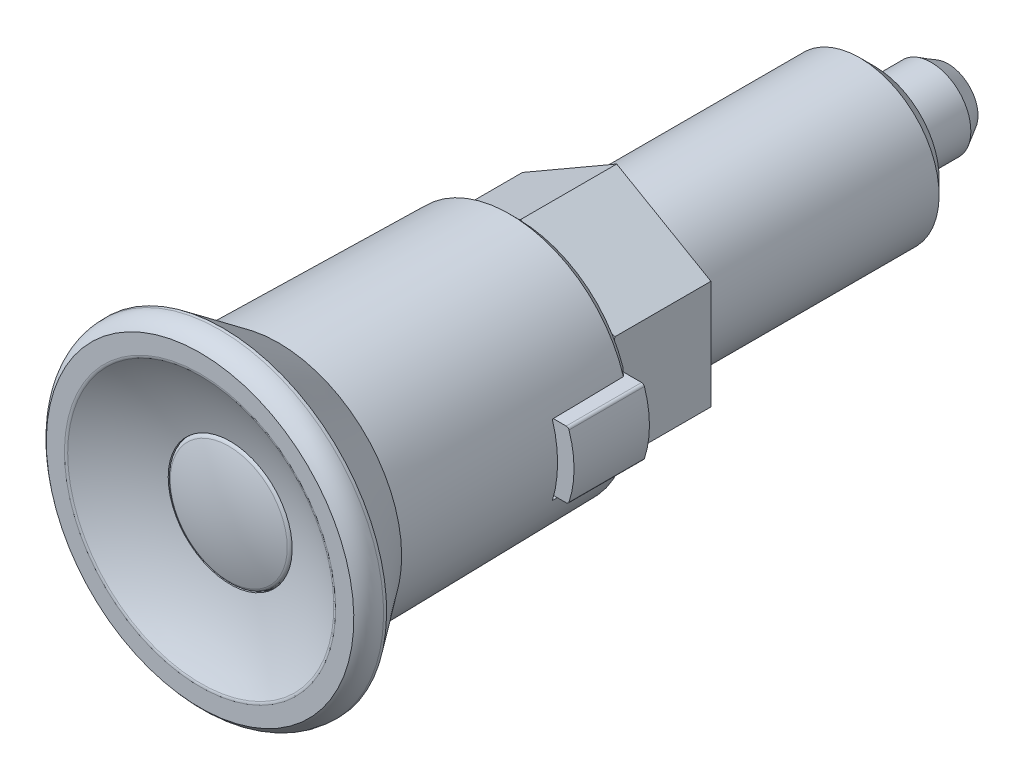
ISO-10303-21;
HEADER;
FILE_DESCRIPTION(('STEP AP214'),'2;1');
FILE_NAME('part.step','',(''),(''),'','','');
FILE_SCHEMA(('AUTOMOTIVE_DESIGN { 1 0 10303 214 1 1 1 1 }'));
ENDSEC;
DATA;
#1=APPLICATION_CONTEXT('core data for automotive mechanical design processes');
#2=APPLICATION_PROTOCOL_DEFINITION('international standard','automotive_design',2000,#1);
#3=PRODUCT_CONTEXT('',#1,'mechanical');
#4=PRODUCT('Part','Part','',(#3));
#5=PRODUCT_RELATED_PRODUCT_CATEGORY('part','',(#4));
#6=PRODUCT_DEFINITION_FORMATION('','',#4);
#7=PRODUCT_DEFINITION_CONTEXT('part definition',#1,'design');
#8=PRODUCT_DEFINITION('design','',#6,#7);
#9=PRODUCT_DEFINITION_SHAPE('','',#8);
#10=(LENGTH_UNIT() NAMED_UNIT(*) SI_UNIT(.MILLI.,.METRE.));
#11=(NAMED_UNIT(*) PLANE_ANGLE_UNIT() SI_UNIT($,.RADIAN.));
#12=(NAMED_UNIT(*) SI_UNIT($,.STERADIAN.) SOLID_ANGLE_UNIT());
#13=UNCERTAINTY_MEASURE_WITH_UNIT(LENGTH_MEASURE(1.E-05),#10,'distance_accuracy_value','');
#14=(GEOMETRIC_REPRESENTATION_CONTEXT(3) GLOBAL_UNCERTAINTY_ASSIGNED_CONTEXT((#13)) GLOBAL_UNIT_ASSIGNED_CONTEXT((#10,
#11,#12)) REPRESENTATION_CONTEXT('',''));
#15=CARTESIAN_POINT('',(0.,0.,0.));
#16=DIRECTION('',(0.,0.,1.));
#17=DIRECTION('',(1.,0.,0.));
#18=AXIS2_PLACEMENT_3D('',#15,#16,#17);
#19=CARTESIAN_POINT('',(9.3,-4.55,18.1));
#20=DIRECTION('',(0.,0.,1.));
#21=DIRECTION('',(0.,-1.,0.));
#22=AXIS2_PLACEMENT_3D('',#19,#20,#21);
#23=PLANE('',#22);
#24=DIRECTION('',(0.,-1.,0.));
#25=VECTOR('',#24,1.);
#26=CARTESIAN_POINT('',(9.8,4.55,18.1));
#27=LINE('',#26,#25);
#28=CARTESIAN_POINT('',(9.8,3.55,18.1));
#29=VERTEX_POINT('',#28);
#30=CARTESIAN_POINT('',(9.8,-3.55,18.1));
#31=VERTEX_POINT('',#30);
#32=EDGE_CURVE('E159',#29,#31,#27,.T.);
#33=ORIENTED_EDGE('',*,*,#32,.F.);
#34=DIRECTION('',(-1.,0.,0.));
#35=VECTOR('',#34,1.);
#36=CARTESIAN_POINT('',(16.5,3.55,18.1));
#37=LINE('',#36,#35);
#38=CARTESIAN_POINT('',(11.6108033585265,3.55,18.1));
#39=VERTEX_POINT('',#38);
#40=EDGE_CURVE('E182',#39,#29,#37,.T.);
#41=ORIENTED_EDGE('',*,*,#40,.F.);
#42=CARTESIAN_POINT('',(0.,0.,18.1));
#43=DIRECTION('',(0.,0.,1.));
#44=DIRECTION('',(0.,-1.,0.));
#45=AXIS2_PLACEMENT_3D('',#42,#43,#44);
#46=CIRCLE('',#45,12.1413860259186);
#47=CARTESIAN_POINT('',(11.6108033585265,-3.55,18.1));
#48=VERTEX_POINT('',#47);
#49=EDGE_CURVE('E283',#48,#39,#46,.T.);
#50=ORIENTED_EDGE('',*,*,#49,.F.);
#51=DIRECTION('',(1.,0.,0.));
#52=VECTOR('',#51,1.);
#53=CARTESIAN_POINT('',(9.8,-3.55,18.1));
#54=LINE('',#53,#52);
#55=EDGE_CURVE('E179',#31,#48,#54,.T.);
#56=ORIENTED_EDGE('',*,*,#55,.F.);
#57=EDGE_LOOP('',(#33,#41,#50,#56));
#58=FACE_BOUND('',#57,.T.);
#59=ADVANCED_FACE('F14',(#58),#23,.F.);
#60=CARTESIAN_POINT('',(0.,0.,64.2));
#61=DIRECTION('',(0.,0.,-1.));
#62=DIRECTION('',(-1.,0.,0.));
#63=AXIS2_PLACEMENT_3D('',#60,#61,#62);
#64=SPHERICAL_SURFACE('',#63,26.);
#65=CARTESIAN_POINT('',(0.,0.,41.9283018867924));
#66=DIRECTION('',(0.,0.,-1.));
#67=DIRECTION('',(0.,1.,0.));
#68=AXIS2_PLACEMENT_3D('',#65,#66,#67);
#69=CIRCLE('',#68,13.4153443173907);
#70=CARTESIAN_POINT('',(-13.4153443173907,0.,41.9283018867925));
#71=VERTEX_POINT('',#70);
#72=EDGE_CURVE('E301',#71,#71,#69,.T.);
#73=CARTESIAN_POINT('',(0.,0.,38.9623792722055));
#74=DIRECTION('',(0.,0.,1.));
#75=DIRECTION('',(0.,-1.,0.));
#76=AXIS2_PLACEMENT_3D('',#73,#74,#75);
#77=CIRCLE('',#76,6.25);
#78=CARTESIAN_POINT('',(-6.24999999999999,0.,38.9623792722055));
#79=VERTEX_POINT('',#78);
#80=EDGE_CURVE('E494',#79,#79,#77,.T.);
#81=CARTESIAN_POINT('',(-13.4153443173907,0.,41.9283018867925));
#82=CARTESIAN_POINT('',(-13.3458883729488,0.,41.8864651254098));
#83=CARTESIAN_POINT('',(-13.2762367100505,0.,41.8449532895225));
#84=CARTESIAN_POINT('',(-13.1365480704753,0.,41.762583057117));
#85=CARTESIAN_POINT('',(-13.0665110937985,0.,41.7217246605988));
#86=CARTESIAN_POINT('',(-12.9260579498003,0.,41.6406648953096));
#87=CARTESIAN_POINT('',(-12.8556417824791,0.,41.6004635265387));
#88=CARTESIAN_POINT('',(-12.7144364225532,0.,41.5207213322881));
#89=CARTESIAN_POINT('',(-12.6436472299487,0.,41.4811805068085));
#90=CARTESIAN_POINT('',(-12.5017020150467,0.,41.4027628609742));
#91=CARTESIAN_POINT('',(-12.4305459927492,0.,41.3638860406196));
#92=CARTESIAN_POINT('',(-12.2878733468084,0.,41.2867998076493));
#93=CARTESIAN_POINT('',(-12.2163567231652,0.,41.2485903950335));
#94=CARTESIAN_POINT('',(-12.0729691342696,0.,41.1728423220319));
#95=CARTESIAN_POINT('',(-12.0010981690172,0.,41.1353036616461));
#96=CARTESIAN_POINT('',(-11.8570081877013,0.,41.0609003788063));
#97=CARTESIAN_POINT('',(-11.7847891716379,0.,41.0240357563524));
#98=CARTESIAN_POINT('',(-11.6400094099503,0.,40.9509837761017));
#99=CARTESIAN_POINT('',(-11.5674486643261,0.,40.9147964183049));
#100=CARTESIAN_POINT('',(-11.4219917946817,0.,40.8431021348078));
#101=CARTESIAN_POINT('',(-11.3490956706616,0.,40.8075952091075));
#102=CARTESIAN_POINT('',(-11.2029744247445,0.,40.7372648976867));
#103=CARTESIAN_POINT('',(-11.1297493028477,0.,40.7024415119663));
#104=CARTESIAN_POINT('',(-10.9829764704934,0.,40.6334813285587));
#105=CARTESIAN_POINT('',(-10.9094287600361,0.,40.5993445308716));
#106=CARTESIAN_POINT('',(-10.762017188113,0.,40.5317605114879));
#107=CARTESIAN_POINT('',(-10.6881533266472,0.,40.4983132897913));
#108=CARTESIAN_POINT('',(-10.5401159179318,0.,40.4321113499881));
#109=CARTESIAN_POINT('',(-10.4659423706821,0.,40.3993566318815));
#110=CARTESIAN_POINT('',(-10.3172920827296,0.,40.3345425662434));
#111=CARTESIAN_POINT('',(-10.2428153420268,0.,40.302483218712));
#112=CARTESIAN_POINT('',(-10.0935651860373,0.,40.2390627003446));
#113=CARTESIAN_POINT('',(-10.0187917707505,0.,40.2077015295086));
#114=CARTESIAN_POINT('',(-9.86895481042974,0.,40.1456801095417));
#115=CARTESIAN_POINT('',(-9.7938912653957,0.,40.1150198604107));
#116=CARTESIAN_POINT('',(-9.64348061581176,0.,40.0544029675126));
#117=CARTESIAN_POINT('',(-9.56813351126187,0.,40.0244463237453));
#118=CARTESIAN_POINT('',(-9.41716233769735,0.,39.9652392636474));
#119=CARTESIAN_POINT('',(-9.34153826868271,0.,39.9359888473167));
#120=CARTESIAN_POINT('',(-9.1900197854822,0.,39.8781968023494));
#121=CARTESIAN_POINT('',(-9.11412537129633,0.,39.8496551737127));
#122=CARTESIAN_POINT('',(-8.96207284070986,0.,39.7932832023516));
#123=CARTESIAN_POINT('',(-8.88591472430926,0.,39.7654528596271));
#124=CARTESIAN_POINT('',(-8.73334145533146,0.,39.7105058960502));
#125=CARTESIAN_POINT('',(-8.65692630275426,0.,39.6833892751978));
#126=CARTESIAN_POINT('',(-8.50384564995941,0.,39.6298721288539));
#127=CARTESIAN_POINT('',(-8.42718014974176,0.,39.6034716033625));
#128=CARTESIAN_POINT('',(-8.27360551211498,0.,39.5513889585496));
#129=CARTESIAN_POINT('',(-8.19669637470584,0.,39.5257068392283));
#130=CARTESIAN_POINT('',(-8.04264119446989,0.,39.4750632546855));
#131=CARTESIAN_POINT('',(-7.96549515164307,0.,39.450101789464));
#132=CARTESIAN_POINT('',(-7.81097291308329,0.,39.400901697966));
#133=CARTESIAN_POINT('',(-7.73359671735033,0.,39.3766630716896));
#134=CARTESIAN_POINT('',(-7.5786209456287,0.,39.3289107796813));
#135=CARTESIAN_POINT('',(-7.50102136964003,0.,39.3053971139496));
#136=CARTESIAN_POINT('',(-7.34560562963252,0.,39.2590968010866));
#137=CARTESIAN_POINT('',(-7.26778946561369,0.,39.2363101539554));
#138=CARTESIAN_POINT('',(-7.11194736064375,0.,39.1914658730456));
#139=CARTESIAN_POINT('',(-7.03392141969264,0.,39.1694082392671));
#140=CARTESIAN_POINT('',(-6.87766659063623,0.,39.1260239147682));
#141=CARTESIAN_POINT('',(-6.79943770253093,0.,39.1046972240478));
#142=CARTESIAN_POINT('',(-6.64278382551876,0.,39.0627766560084));
#143=CARTESIAN_POINT('',(-6.56435883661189,0.,39.0421827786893));
#144=CARTESIAN_POINT('',(-6.40731962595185,0.,39.0017296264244));
#145=CARTESIAN_POINT('',(-6.32870540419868,0.,38.9818703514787));
#146=CARTESIAN_POINT('',(-6.24999999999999,0.,38.9623792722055));
#147=B_SPLINE_CURVE_WITH_KNOTS('',3,(#81,#82,#83,#84,#85,#86,#87,#88,#89,#90,#91,#92,#93,#94,
#95,#96,#97,#98,#99,#100,#101,#102,#103,#104,#105,#106,#107,#108,#109,#110,#111,#112,#113,#114,
#115,#116,#117,#118,#119,#120,#121,#122,#123,#124,#125,#126,#127,#128,#129,#130,#131,#132,#133,
#134,#135,#136,#137,#138,#139,#140,#141,#142,#143,#144,#145,#146),.UNSPECIFIED.,.F.,.F.,(4,2,2,
2,2,2,2,2,2,2,2,2,2,2,2,2,2,2,2,2,2,2,2,2,2,2,2,2,2,2,2,2,4),(0.,0.243247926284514,
0.486495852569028,0.729743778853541,0.972991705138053,1.21623963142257,1.45948755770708,
1.7027354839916,1.94598341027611,2.18923133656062,2.43247926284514,2.67572718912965,
2.91897511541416,3.16222304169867,3.40547096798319,3.6487188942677,3.89196682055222,
4.13521474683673,4.37846267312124,4.62171059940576,4.86495852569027,5.10820645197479,
5.3514543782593,5.59470230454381,5.83795023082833,6.08119815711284,6.32444608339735,
6.56769400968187,6.81094193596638,7.05418986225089,7.29743778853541,7.54068571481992,
7.78393364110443),.UNSPECIFIED.);
#148=EDGE_CURVE('BSEAM16',#71,#79,#147,.T.);
#149=ORIENTED_EDGE('',*,*,#72,.F.);
#150=ORIENTED_EDGE('',*,*,#80,.F.);
#151=ORIENTED_EDGE('',*,*,#148,.T.);
#152=ORIENTED_EDGE('',*,*,#148,.F.);
#153=EDGE_LOOP('',(#149,#151,#150,#152));
#154=FACE_BOUND('',#153,.T.);
#155=ADVANCED_FACE('F16',(#154),#64,.F.);
#156=CARTESIAN_POINT('',(0.,0.,10.));
#157=DIRECTION('',(0.,0.,-1.));
#158=DIRECTION('',(0.,1.,0.));
#159=AXIS2_PLACEMENT_3D('',#156,#157,#158);
#160=CONICAL_SURFACE('',#159,9.5,1.36135681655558);
#161=CARTESIAN_POINT('',(-9.5,14.5329336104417,8.32877554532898));
#162=CARTESIAN_POINT('',(-9.5,14.1013570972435,8.40553990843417));
#163=CARTESIAN_POINT('',(-9.5,13.6696077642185,8.48134980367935));
#164=CARTESIAN_POINT('',(-9.5,12.8056798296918,8.63055194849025));
#165=CARTESIAN_POINT('',(-9.5,12.3735012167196,8.70394413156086));
#166=CARTESIAN_POINT('',(-9.5,11.5083909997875,8.8478417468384));
#167=CARTESIAN_POINT('',(-9.5,11.0754590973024,8.91834539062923));
#168=CARTESIAN_POINT('',(-9.5,10.2090221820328,9.05573636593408));
#169=CARTESIAN_POINT('',(-9.5,9.77551717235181,9.12262371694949));
#170=CARTESIAN_POINT('',(-9.5,8.90997113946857,9.2516178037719));
#171=CARTESIAN_POINT('',(-9.5,8.47793339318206,9.31374642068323));
#172=CARTESIAN_POINT('',(-9.5,7.61310957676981,9.43254691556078));
#173=CARTESIAN_POINT('',(-9.5,7.18032351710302,9.48921886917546));
#174=CARTESIAN_POINT('',(-9.5,6.31395168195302,9.59585082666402));
#175=CARTESIAN_POINT('',(-9.5,5.88036596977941,9.64581134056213));
#176=CARTESIAN_POINT('',(-9.5,5.01232298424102,9.73757725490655));
#177=CARTESIAN_POINT('',(-9.5,4.57786571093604,9.77938265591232));
#178=CARTESIAN_POINT('',(-9.5,3.7050826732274,9.85353883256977));
#179=CARTESIAN_POINT('',(-9.5,3.2667510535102,9.88582167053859));
#180=CARTESIAN_POINT('',(-9.5,2.38939284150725,9.93902642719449));
#181=CARTESIAN_POINT('',(-9.5,1.9503662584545,9.95994849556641));
#182=CARTESIAN_POINT('',(-9.5,1.07200933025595,9.98927460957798));
#183=CARTESIAN_POINT('',(-9.5,0.632679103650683,9.99768213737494));
#184=CARTESIAN_POINT('',(-9.5,-0.246038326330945,10.0014817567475));
#185=CARTESIAN_POINT('',(-9.5,-0.685425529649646,9.99687386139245));
#186=CARTESIAN_POINT('',(-9.5,-1.56488299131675,9.974899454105));
#187=CARTESIAN_POINT('',(-9.5,-2.00495250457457,9.95750370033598));
#188=CARTESIAN_POINT('',(-9.5,-2.88446098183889,9.91091726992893));
#189=CARTESIAN_POINT('',(-9.5,-3.32389993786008,9.88172644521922));
#190=CARTESIAN_POINT('',(-9.5,-4.20212718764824,9.81298518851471));
#191=CARTESIAN_POINT('',(-9.5,-4.6409151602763,9.7734307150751));
#192=CARTESIAN_POINT('',(-9.5,-5.51760463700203,9.68557090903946));
#193=CARTESIAN_POINT('',(-9.5,-5.95550613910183,9.63726555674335));
#194=CARTESIAN_POINT('',(-9.5,-6.80881686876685,9.53600307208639));
#195=CARTESIAN_POINT('',(-9.5,-7.22426780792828,9.48339396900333));
#196=CARTESIAN_POINT('',(-9.5,-8.05445875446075,9.37281160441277));
#197=CARTESIAN_POINT('',(-9.5,-8.46919874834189,9.31483824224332));
#198=CARTESIAN_POINT('',(-9.5,-9.29806516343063,9.19450464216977));
#199=CARTESIAN_POINT('',(-9.5,-9.71219154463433,9.13214413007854));
#200=CARTESIAN_POINT('',(-9.5,-10.5398894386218,9.00383477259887));
#201=CARTESIAN_POINT('',(-9.5,-10.9534609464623,8.93788589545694));
#202=CARTESIAN_POINT('',(-9.5,-12.1936209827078,8.73563796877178));
#203=CARTESIAN_POINT('',(-9.5,-13.0194948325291,8.59496143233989));
#204=CARTESIAN_POINT('',(-9.5,-14.6698086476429,8.30570714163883));
#205=CARTESIAN_POINT('',(-9.5,-15.494248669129,8.15712970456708));
#206=CARTESIAN_POINT('',(-9.5,-17.1369689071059,7.85536900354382));
#207=CARTESIAN_POINT('',(-9.5,-17.9552554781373,7.70222023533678));
#208=CARTESIAN_POINT('',(-9.5,-19.5910873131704,7.39197064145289));
#209=CARTESIAN_POINT('',(-9.5,-20.4086325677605,7.23486976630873));
#210=CARTESIAN_POINT('',(-9.5,-22.0424343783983,6.91789805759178));
#211=CARTESIAN_POINT('',(-9.5,-22.8586914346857,6.75802979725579));
#212=CARTESIAN_POINT('',(-9.5,-24.4907456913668,6.4360574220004));
#213=CARTESIAN_POINT('',(-9.5,-25.3065429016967,6.27395335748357));
#214=CARTESIAN_POINT('',(-9.5,-26.1221810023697,6.11106237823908));
#215=B_SPLINE_CURVE_WITH_KNOTS('',3,(#161,#162,#163,#164,#165,#166,#167,#168,#169,#170,#171,
#172,#173,#174,#175,#176,#177,#178,#179,#180,#181,#182,#183,#184,#185,#186,#187,#188,#189,#190,
#191,#192,#193,#194,#195,#196,#197,#198,#199,#200,#201,#202,#203,#204,#205,#206,#207,#208,#209,
#210,#211,#212,#213,#214),.UNSPECIFIED.,.F.,.F.,(4,2,2,2,2,2,2,2,2,2,2,2,2,2,2,2,2,2,2,2,2,2,2,
2,2,2,4),(0.,1.31505455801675,2.63014525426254,3.94603823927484,5.26192412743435,
6.57134237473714,7.88074246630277,9.19004299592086,10.4993434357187,11.8177707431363,
13.1361806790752,14.4542237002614,15.7722653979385,17.0933304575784,18.4144121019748,
19.7360096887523,21.0576102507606,22.3138748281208,23.5701629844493,24.8265297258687,
26.0829075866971,28.5961491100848,31.1092898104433,33.6067601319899,36.1042617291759,
38.5995540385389,41.0947901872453),.UNSPECIFIED.);
#216=CARTESIAN_POINT('',(-9.5,-5.48482755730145,9.68761516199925));
#217=VERTEX_POINT('',#216);
#218=CARTESIAN_POINT('',(-9.5,0.,10.));
#219=VERTEX_POINT('',#218);
#220=EDGE_CURVE('E411',#217,#219,#215,.F.);
#221=ORIENTED_EDGE('',*,*,#220,.F.);
#222=CARTESIAN_POINT('',(0.0002,-10.9697705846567,9.68759061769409));
#223=CARTESIAN_POINT('',(-0.394814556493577,-10.7417088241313,9.73608743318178));
#224=CARTESIAN_POINT('',(-0.790282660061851,-10.5133852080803,9.78007490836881));
#225=CARTESIAN_POINT('',(-1.582098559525,-10.0562300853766,9.85730960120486));
#226=CARTESIAN_POINT('',(-1.97844655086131,-9.82739846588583,9.89055412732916));
#227=CARTESIAN_POINT('',(-2.77050469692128,-9.37010348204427,9.94446737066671));
#228=CARTESIAN_POINT('',(-3.16621272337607,-9.1416413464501,9.96517670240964));
#229=CARTESIAN_POINT('',(-3.95794719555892,-8.68453323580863,9.99294220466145));
#230=CARTESIAN_POINT('',(-4.35397359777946,-8.4558872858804,10.));
#231=CARTESIAN_POINT('',(-5.14602640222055,-7.99859538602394,10.));
#232=CARTESIAN_POINT('',(-5.54205280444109,-7.76994943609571,9.99294220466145));
#233=CARTESIAN_POINT('',(-6.33378727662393,-7.31284132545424,9.96517670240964));
#234=CARTESIAN_POINT('',(-6.72949530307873,-7.08437918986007,9.94446737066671));
#235=CARTESIAN_POINT('',(-7.5215534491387,-6.62708420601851,9.89055412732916));
#236=CARTESIAN_POINT('',(-7.91790144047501,-6.39825258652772,9.85730960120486));
#237=CARTESIAN_POINT('',(-8.70971733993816,-5.94109746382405,9.78007490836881));
#238=CARTESIAN_POINT('',(-9.10518544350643,-5.712773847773,9.73608743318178));
#239=CARTESIAN_POINT('',(-9.5002,-5.48471208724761,9.68759061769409));
#240=B_SPLINE_CURVE_WITH_KNOTS('',3,(#222,#223,#224,#225,#226,#227,#228,#229,#230,#231,#232,
#233,#234,#235,#236,#237,#238,#239),.UNSPECIFIED.,.F.,.F.,(4,2,2,2,2,2,2,2,4),(0.,
1.37612736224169,2.75259923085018,4.12458706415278,5.49641159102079,6.8682361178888,
8.24022395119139,9.61669581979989,10.9928231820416),.UNSPECIFIED.);
#241=CARTESIAN_POINT('',(-4.75,-8.22724133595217,10.));
#242=VERTEX_POINT('',#241);
#243=EDGE_CURVE('E346',#242,#217,#240,.T.);
#244=ORIENTED_EDGE('',*,*,#243,.F.);
#245=CARTESIAN_POINT('',(0.,0.,10.));
#246=DIRECTION('',(0.,0.,-1.));
#247=DIRECTION('',(0.,1.,0.));
#248=AXIS2_PLACEMENT_3D('',#245,#246,#247);
#249=CIRCLE('',#248,9.5);
#250=EDGE_CURVE('E466',#242,#219,#249,.T.);
#251=ORIENTED_EDGE('',*,*,#250,.T.);
#252=EDGE_LOOP('',(#221,#244,#251));
#253=FACE_BOUND('',#252,.T.);
#254=ADVANCED_FACE('F270',(#253),#160,.T.);
#255=CARTESIAN_POINT('',(-9.5,5.48482755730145,9.68761516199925));
#256=VERTEX_POINT('',#255);
#257=EDGE_CURVE('E412',#219,#256,#215,.F.);
#258=ORIENTED_EDGE('',*,*,#257,.F.);
#259=CARTESIAN_POINT('',(-4.75,8.22724133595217,10.));
#260=VERTEX_POINT('',#259);
#261=EDGE_CURVE('E471',#219,#260,#249,.T.);
#262=ORIENTED_EDGE('',*,*,#261,.T.);
#263=CARTESIAN_POINT('',(-9.5002,5.48471208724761,9.68759061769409));
#264=CARTESIAN_POINT('',(-9.10518544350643,5.712773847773,9.73608743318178));
#265=CARTESIAN_POINT('',(-8.70971733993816,5.94109746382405,9.7800749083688));
#266=CARTESIAN_POINT('',(-7.91790144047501,6.39825258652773,9.85730960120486));
#267=CARTESIAN_POINT('',(-7.5215534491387,6.62708420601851,9.89055412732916));
#268=CARTESIAN_POINT('',(-6.72949530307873,7.08437918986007,9.94446737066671));
#269=CARTESIAN_POINT('',(-6.33378727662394,7.31284132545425,9.96517670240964));
#270=CARTESIAN_POINT('',(-5.54205280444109,7.76994943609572,9.99294220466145));
#271=CARTESIAN_POINT('',(-5.14602640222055,7.99859538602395,10.));
#272=CARTESIAN_POINT('',(-4.35397359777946,8.4558872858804,10.));
#273=CARTESIAN_POINT('',(-3.95794719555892,8.68453323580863,9.99294220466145));
#274=CARTESIAN_POINT('',(-3.16621272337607,9.14164134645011,9.96517670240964));
#275=CARTESIAN_POINT('',(-2.77050469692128,9.37010348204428,9.94446737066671));
#276=CARTESIAN_POINT('',(-1.97844655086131,9.82739846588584,9.89055412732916));
#277=CARTESIAN_POINT('',(-1.582098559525,10.0562300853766,9.85730960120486));
#278=CARTESIAN_POINT('',(-0.790282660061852,10.5133852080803,9.7800749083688));
#279=CARTESIAN_POINT('',(-0.394814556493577,10.7417088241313,9.73608743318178));
#280=CARTESIAN_POINT('',(0.000200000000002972,10.9697705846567,9.68759061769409));
#281=B_SPLINE_CURVE_WITH_KNOTS('',3,(#263,#264,#265,#266,#267,#268,#269,#270,#271,#272,#273,
#274,#275,#276,#277,#278,#279,#280),.UNSPECIFIED.,.F.,.F.,(4,2,2,2,2,2,2,2,4),(0.,
1.37612736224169,2.75259923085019,4.12458706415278,5.49641159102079,6.8682361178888,
8.24022395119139,9.61669581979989,10.9928231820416),.UNSPECIFIED.);
#282=EDGE_CURVE('E419',#256,#260,#281,.T.);
#283=ORIENTED_EDGE('',*,*,#282,.F.);
#284=EDGE_LOOP('',(#258,#262,#283));
#285=FACE_BOUND('',#284,.T.);
#286=ADVANCED_FACE('F480',(#285),#160,.T.);
#287=CARTESIAN_POINT('',(0.,10.9696551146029,9.68761516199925));
#288=VERTEX_POINT('',#287);
#289=EDGE_CURVE('E420',#260,#288,#281,.T.);
#290=ORIENTED_EDGE('',*,*,#289,.F.);
#291=CARTESIAN_POINT('',(4.75,8.22724133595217,10.));
#292=VERTEX_POINT('',#291);
#293=EDGE_CURVE('E186',#260,#292,#249,.T.);
#294=ORIENTED_EDGE('',*,*,#293,.T.);
#295=CARTESIAN_POINT('',(-0.0002,10.9697705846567,9.68759061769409));
#296=CARTESIAN_POINT('',(0.394814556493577,10.7417088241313,9.73608743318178));
#297=CARTESIAN_POINT('',(0.790282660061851,10.5133852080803,9.78007490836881));
#298=CARTESIAN_POINT('',(1.582098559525,10.0562300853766,9.85730960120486));
#299=CARTESIAN_POINT('',(1.97844655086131,9.82739846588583,9.89055412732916));
#300=CARTESIAN_POINT('',(2.77050469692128,9.37010348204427,9.94446737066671));
#301=CARTESIAN_POINT('',(3.16621272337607,9.1416413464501,9.96517670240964));
#302=CARTESIAN_POINT('',(3.95794719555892,8.68453323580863,9.99294220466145));
#303=CARTESIAN_POINT('',(4.35397359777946,8.4558872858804,10.));
#304=CARTESIAN_POINT('',(5.14602640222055,7.99859538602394,10.));
#305=CARTESIAN_POINT('',(5.54205280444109,7.76994943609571,9.99294220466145));
#306=CARTESIAN_POINT('',(6.33378727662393,7.31284132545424,9.96517670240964));
#307=CARTESIAN_POINT('',(6.72949530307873,7.08437918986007,9.94446737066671));
#308=CARTESIAN_POINT('',(7.5215534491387,6.62708420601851,9.89055412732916));
#309=CARTESIAN_POINT('',(7.91790144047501,6.39825258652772,9.85730960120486));
#310=CARTESIAN_POINT('',(8.70971733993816,5.94109746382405,9.78007490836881));
#311=CARTESIAN_POINT('',(9.10518544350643,5.712773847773,9.73608743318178));
#312=CARTESIAN_POINT('',(9.5002,5.48471208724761,9.68759061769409));
#313=B_SPLINE_CURVE_WITH_KNOTS('',3,(#295,#296,#297,#298,#299,#300,#301,#302,#303,#304,#305,
#306,#307,#308,#309,#310,#311,#312),.UNSPECIFIED.,.F.,.F.,(4,2,2,2,2,2,2,2,4),(0.,
1.37612736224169,2.75259923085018,4.12458706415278,5.49641159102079,6.8682361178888,
8.24022395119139,9.61669581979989,10.9928231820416),.UNSPECIFIED.);
#314=EDGE_CURVE('E443',#288,#292,#313,.T.);
#315=ORIENTED_EDGE('',*,*,#314,.F.);
#316=EDGE_LOOP('',(#290,#294,#315));
#317=FACE_BOUND('',#316,.T.);
#318=ADVANCED_FACE('F484',(#317),#160,.T.);
#319=CARTESIAN_POINT('',(9.5,5.48482755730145,9.68761516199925));
#320=VERTEX_POINT('',#319);
#321=EDGE_CURVE('E326',#292,#320,#313,.T.);
#322=ORIENTED_EDGE('',*,*,#321,.F.);
#323=CARTESIAN_POINT('',(9.5,0.,10.));
#324=VERTEX_POINT('',#323);
#325=EDGE_CURVE('E187',#292,#324,#249,.T.);
#326=ORIENTED_EDGE('',*,*,#325,.T.);
#327=CARTESIAN_POINT('',(9.5,14.5329336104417,8.32877554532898));
#328=CARTESIAN_POINT('',(9.5,14.1013570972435,8.40553990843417));
#329=CARTESIAN_POINT('',(9.5,13.6696077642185,8.48134980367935));
#330=CARTESIAN_POINT('',(9.5,12.8056798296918,8.63055194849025));
#331=CARTESIAN_POINT('',(9.5,12.3735012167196,8.70394413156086));
#332=CARTESIAN_POINT('',(9.5,11.5083909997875,8.8478417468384));
#333=CARTESIAN_POINT('',(9.5,11.0754590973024,8.91834539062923));
#334=CARTESIAN_POINT('',(9.5,10.2090221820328,9.05573636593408));
#335=CARTESIAN_POINT('',(9.5,9.77551717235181,9.12262371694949));
#336=CARTESIAN_POINT('',(9.5,8.90997113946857,9.2516178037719));
#337=CARTESIAN_POINT('',(9.5,8.47793339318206,9.31374642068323));
#338=CARTESIAN_POINT('',(9.5,7.61310957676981,9.43254691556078));
#339=CARTESIAN_POINT('',(9.5,7.18032351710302,9.48921886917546));
#340=CARTESIAN_POINT('',(9.5,6.31395168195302,9.59585082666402));
#341=CARTESIAN_POINT('',(9.5,5.88036596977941,9.64581134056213));
#342=CARTESIAN_POINT('',(9.5,5.01232298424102,9.73757725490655));
#343=CARTESIAN_POINT('',(9.5,4.57786571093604,9.77938265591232));
#344=CARTESIAN_POINT('',(9.5,3.7050826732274,9.85353883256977));
#345=CARTESIAN_POINT('',(9.5,3.2667510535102,9.88582167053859));
#346=CARTESIAN_POINT('',(9.5,2.38939284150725,9.93902642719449));
#347=CARTESIAN_POINT('',(9.5,1.9503662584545,9.95994849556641));
#348=CARTESIAN_POINT('',(9.5,1.07200933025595,9.98927460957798));
#349=CARTESIAN_POINT('',(9.5,0.632679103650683,9.99768213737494));
#350=CARTESIAN_POINT('',(9.5,-0.246038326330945,10.0014817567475));
#351=CARTESIAN_POINT('',(9.5,-0.685425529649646,9.99687386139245));
#352=CARTESIAN_POINT('',(9.5,-1.56488299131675,9.974899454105));
#353=CARTESIAN_POINT('',(9.5,-2.00495250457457,9.95750370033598));
#354=CARTESIAN_POINT('',(9.5,-2.88446098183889,9.91091726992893));
#355=CARTESIAN_POINT('',(9.5,-3.32389993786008,9.88172644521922));
#356=CARTESIAN_POINT('',(9.5,-4.20212718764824,9.81298518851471));
#357=CARTESIAN_POINT('',(9.5,-4.6409151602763,9.7734307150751));
#358=CARTESIAN_POINT('',(9.5,-5.51760463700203,9.68557090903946));
#359=CARTESIAN_POINT('',(9.5,-5.95550613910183,9.63726555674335));
#360=CARTESIAN_POINT('',(9.5,-6.80881686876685,9.53600307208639));
#361=CARTESIAN_POINT('',(9.5,-7.22426780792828,9.48339396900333));
#362=CARTESIAN_POINT('',(9.5,-8.05445875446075,9.37281160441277));
#363=CARTESIAN_POINT('',(9.5,-8.46919874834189,9.31483824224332));
#364=CARTESIAN_POINT('',(9.5,-9.29806516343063,9.19450464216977));
#365=CARTESIAN_POINT('',(9.5,-9.71219154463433,9.13214413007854));
#366=CARTESIAN_POINT('',(9.5,-10.5398894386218,9.00383477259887));
#367=CARTESIAN_POINT('',(9.5,-10.9534609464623,8.93788589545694));
#368=CARTESIAN_POINT('',(9.5,-12.1936209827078,8.73563796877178));
#369=CARTESIAN_POINT('',(9.5,-13.0194948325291,8.59496143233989));
#370=CARTESIAN_POINT('',(9.5,-14.6698086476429,8.30570714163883));
#371=CARTESIAN_POINT('',(9.5,-15.494248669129,8.15712970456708));
#372=CARTESIAN_POINT('',(9.5,-17.1369689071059,7.85536900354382));
#373=CARTESIAN_POINT('',(9.5,-17.9552554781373,7.70222023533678));
#374=CARTESIAN_POINT('',(9.5,-19.5910873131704,7.39197064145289));
#375=CARTESIAN_POINT('',(9.5,-20.4086325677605,7.23486976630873));
#376=CARTESIAN_POINT('',(9.5,-22.0424343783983,6.91789805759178));
#377=CARTESIAN_POINT('',(9.5,-22.8586914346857,6.75802979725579));
#378=CARTESIAN_POINT('',(9.5,-24.4907456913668,6.4360574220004));
#379=CARTESIAN_POINT('',(9.5,-25.3065429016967,6.27395335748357));
#380=CARTESIAN_POINT('',(9.5,-26.1221810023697,6.11106237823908));
#381=B_SPLINE_CURVE_WITH_KNOTS('',3,(#327,#328,#329,#330,#331,#332,#333,#334,#335,#336,#337,
#338,#339,#340,#341,#342,#343,#344,#345,#346,#347,#348,#349,#350,#351,#352,#353,#354,#355,#356,
#357,#358,#359,#360,#361,#362,#363,#364,#365,#366,#367,#368,#369,#370,#371,#372,#373,#374,#375,
#376,#377,#378,#379,#380),.UNSPECIFIED.,.F.,.F.,(4,2,2,2,2,2,2,2,2,2,2,2,2,2,2,2,2,2,2,2,2,2,2,
2,2,2,4),(0.,1.31505455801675,2.63014525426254,3.94603823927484,5.26192412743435,
6.57134237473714,7.88074246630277,9.19004299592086,10.4993434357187,11.8177707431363,
13.1361806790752,14.4542237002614,15.7722653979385,17.0933304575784,18.4144121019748,
19.7360096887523,21.0576102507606,22.3138748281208,23.5701629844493,24.8265297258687,
26.0829075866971,28.5961491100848,31.1092898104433,33.6067601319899,36.1042617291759,
38.5995540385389,41.0947901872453),.UNSPECIFIED.);
#382=EDGE_CURVE('E444',#320,#324,#381,.T.);
#383=ORIENTED_EDGE('',*,*,#382,.F.);
#384=EDGE_LOOP('',(#322,#326,#383));
#385=FACE_BOUND('',#384,.T.);
#386=ADVANCED_FACE('F477',(#385),#160,.T.);
#387=CARTESIAN_POINT('',(9.5,-5.48482755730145,9.68761516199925));
#388=VERTEX_POINT('',#387);
#389=EDGE_CURVE('E445',#324,#388,#381,.T.);
#390=ORIENTED_EDGE('',*,*,#389,.F.);
#391=CARTESIAN_POINT('',(4.75,-8.22724133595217,10.));
#392=VERTEX_POINT('',#391);
#393=EDGE_CURVE('E180',#324,#392,#249,.T.);
#394=ORIENTED_EDGE('',*,*,#393,.T.);
#395=CARTESIAN_POINT('',(9.5002,-5.48471208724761,9.68759061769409));
#396=CARTESIAN_POINT('',(9.10518544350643,-5.712773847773,9.73608743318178));
#397=CARTESIAN_POINT('',(8.70971733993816,-5.94109746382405,9.7800749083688));
#398=CARTESIAN_POINT('',(7.91790144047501,-6.39825258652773,9.85730960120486));
#399=CARTESIAN_POINT('',(7.5215534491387,-6.62708420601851,9.89055412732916));
#400=CARTESIAN_POINT('',(6.72949530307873,-7.08437918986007,9.94446737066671));
#401=CARTESIAN_POINT('',(6.33378727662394,-7.31284132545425,9.96517670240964));
#402=CARTESIAN_POINT('',(5.54205280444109,-7.76994943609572,9.99294220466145));
#403=CARTESIAN_POINT('',(5.14602640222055,-7.99859538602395,10.));
#404=CARTESIAN_POINT('',(4.35397359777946,-8.4558872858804,10.));
#405=CARTESIAN_POINT('',(3.95794719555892,-8.68453323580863,9.99294220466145));
#406=CARTESIAN_POINT('',(3.16621272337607,-9.14164134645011,9.96517670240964));
#407=CARTESIAN_POINT('',(2.77050469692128,-9.37010348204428,9.94446737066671));
#408=CARTESIAN_POINT('',(1.97844655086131,-9.82739846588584,9.89055412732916));
#409=CARTESIAN_POINT('',(1.582098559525,-10.0562300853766,9.85730960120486));
#410=CARTESIAN_POINT('',(0.790282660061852,-10.5133852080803,9.7800749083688));
#411=CARTESIAN_POINT('',(0.394814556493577,-10.7417088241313,9.73608743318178));
#412=CARTESIAN_POINT('',(-0.000200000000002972,-10.9697705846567,9.68759061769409));
#413=B_SPLINE_CURVE_WITH_KNOTS('',3,(#395,#396,#397,#398,#399,#400,#401,#402,#403,#404,#405,
#406,#407,#408,#409,#410,#411,#412),.UNSPECIFIED.,.F.,.F.,(4,2,2,2,2,2,2,2,4),(0.,
1.37612736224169,2.75259923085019,4.12458706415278,5.49641159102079,6.8682361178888,
8.24022395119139,9.61669581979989,10.9928231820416),.UNSPECIFIED.);
#414=EDGE_CURVE('E450',#388,#392,#413,.T.);
#415=ORIENTED_EDGE('',*,*,#414,.F.);
#416=EDGE_LOOP('',(#390,#394,#415));
#417=FACE_BOUND('',#416,.T.);
#418=ADVANCED_FACE('F473',(#417),#160,.T.);
#419=CARTESIAN_POINT('',(0.,-10.9696551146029,9.68761516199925));
#420=VERTEX_POINT('',#419);
#421=EDGE_CURVE('E361',#392,#420,#413,.T.);
#422=ORIENTED_EDGE('',*,*,#421,.F.);
#423=EDGE_CURVE('E184',#392,#242,#249,.T.);
#424=ORIENTED_EDGE('',*,*,#423,.T.);
#425=EDGE_CURVE('E360',#420,#242,#240,.T.);
#426=ORIENTED_EDGE('',*,*,#425,.F.);
#427=EDGE_LOOP('',(#422,#424,#426));
#428=FACE_BOUND('',#427,.T.);
#429=ADVANCED_FACE('F238',(#428),#160,.T.);
#430=CARTESIAN_POINT('',(0.,0.,34.1));
#431=DIRECTION('',(0.,0.,1.));
#432=DIRECTION('',(0.,-1.,0.));
#433=AXIS2_PLACEMENT_3D('',#430,#431,#432);
#434=CONICAL_SURFACE('',#433,12.42066706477,0.0174532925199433);
#435=CARTESIAN_POINT('',(11.7734384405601,-3.55,27.015453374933));
#436=CARTESIAN_POINT('',(11.6804021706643,-3.55,21.9120879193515));
#437=CARTESIAN_POINT('',(11.5872670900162,-3.55,16.8087242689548));
#438=CARTESIAN_POINT('',(11.4007993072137,-3.55,6.60200057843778));
#439=CARTESIAN_POINT('',(11.3074666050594,-3.55,1.49864053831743));
#440=CARTESIAN_POINT('',(11.2140350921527,-3.55,-3.60471769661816));
#441=B_SPLINE_CURVE_WITH_KNOTS('',3,(#435,#436,#437,#438,#439,#440),.UNSPECIFIED.,.F.,.F.,(4,2,
4),(0.,15.3126402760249,30.6252805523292),.UNSPECIFIED.);
#442=CARTESIAN_POINT('',(11.477490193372,-3.55,10.7998781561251));
#443=VERTEX_POINT('',#442);
#444=EDGE_CURVE('E226',#48,#443,#441,.T.);
#445=ORIENTED_EDGE('',*,*,#444,.F.);
#446=ORIENTED_EDGE('',*,*,#49,.T.);
#447=CARTESIAN_POINT('',(11.2140350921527,3.55,-3.60471769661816));
#448=CARTESIAN_POINT('',(11.3074666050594,3.55,1.49864053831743));
#449=CARTESIAN_POINT('',(11.4007993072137,3.55,6.60200057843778));
#450=CARTESIAN_POINT('',(11.5872670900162,3.55,16.8087242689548));
#451=CARTESIAN_POINT('',(11.6804021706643,3.55,21.9120879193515));
#452=CARTESIAN_POINT('',(11.7734384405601,3.55,27.015453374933));
#453=B_SPLINE_CURVE_WITH_KNOTS('',3,(#447,#448,#449,#450,#451,#452),.UNSPECIFIED.,.F.,.F.,(4,2,
4),(0.,15.3126402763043,30.6252805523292),.UNSPECIFIED.);
#454=CARTESIAN_POINT('',(11.477490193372,3.55,10.7998781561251));
#455=VERTEX_POINT('',#454);
#456=EDGE_CURVE('E198',#455,#39,#453,.T.);
#457=ORIENTED_EDGE('',*,*,#456,.F.);
#458=CARTESIAN_POINT('',(0.,0.,10.7998781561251));
#459=DIRECTION('',(0.,0.,-1.));
#460=DIRECTION('',(0.,1.,0.));
#461=AXIS2_PLACEMENT_3D('',#458,#459,#460);
#462=CIRCLE('',#461,12.0139619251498);
#463=EDGE_CURVE('E282',#443,#455,#462,.T.);
#464=ORIENTED_EDGE('',*,*,#463,.F.);
#465=EDGE_LOOP('',(#445,#446,#457,#464));
#466=FACE_BOUND('',#465,.T.);
#467=CARTESIAN_POINT('',(0.,0.,34.1));
#468=DIRECTION('',(0.,0.,-1.));
#469=DIRECTION('',(0.,1.,0.));
#470=AXIS2_PLACEMENT_3D('',#467,#468,#469);
#471=CIRCLE('',#470,12.42066706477);
#472=CARTESIAN_POINT('',(0.,12.42066706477,34.1));
#473=VERTEX_POINT('',#472);
#474=EDGE_CURVE('E285',#473,#473,#471,.T.);
#475=ORIENTED_EDGE('',*,*,#474,.T.);
#476=EDGE_LOOP('',(#475));
#477=FACE_BOUND('',#476,.T.);
#478=ADVANCED_FACE('F234',(#466,#477),#434,.T.);
#479=CARTESIAN_POINT('',(0.,0.,10.7998781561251));
#480=DIRECTION('',(0.,0.,1.));
#481=DIRECTION('',(0.,-1.,0.));
#482=AXIS2_PLACEMENT_3D('',#479,#480,#481);
#483=CONICAL_SURFACE('',#482,12.0139619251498,0.79412480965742);
#484=CARTESIAN_POINT('',(14.2074365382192,-3.55,13.384644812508));
#485=CARTESIAN_POINT('',(13.9268449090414,-3.55,13.1171360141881));
#486=CARTESIAN_POINT('',(13.6460251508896,-3.55,12.849866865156));
#487=CARTESIAN_POINT('',(13.0838291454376,-3.55,12.3159143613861));
#488=CARTESIAN_POINT('',(12.8024528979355,-3.55,12.0492310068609));
#489=CARTESIAN_POINT('',(11.9573796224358,-3.55,11.2502577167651));
#490=CARTESIAN_POINT('',(11.3926980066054,-3.55,10.7190063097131));
#491=CARTESIAN_POINT('',(10.5426831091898,-3.55,9.9252976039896));
#492=CARTESIAN_POINT('',(10.2588370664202,-3.55,9.66124782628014));
#493=CARTESIAN_POINT('',(9.68988890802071,-3.55,9.13450814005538));
#494=CARTESIAN_POINT('',(9.40478680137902,-3.55,8.87181822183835));
#495=CARTESIAN_POINT('',(8.83296060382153,-3.55,8.34816610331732));
#496=CARTESIAN_POINT('',(8.54623639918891,-3.55,8.08720402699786));
#497=CARTESIAN_POINT('',(8.1145773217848,-3.55,7.69749580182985));
#498=CARTESIAN_POINT('',(7.9704270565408,-3.55,7.56788062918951));
#499=CARTESIAN_POINT('',(7.68151712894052,-3.55,7.30932962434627));
#500=CARTESIAN_POINT('',(7.53675746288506,-3.55,7.18039379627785));
#501=CARTESIAN_POINT('',(7.39165082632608,-3.55,7.05184840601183));
#502=B_SPLINE_CURVE_WITH_KNOTS('',3,(#484,#485,#486,#487,#488,#489,#490,#491,#492,#493,#494,
#495,#496,#497,#498,#499,#500,#501),.UNSPECIFIED.,.F.,.F.,(4,2,2,2,2,2,2,2,4),(0.,
1.16302695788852,2.32605433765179,4.65194295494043,5.8149606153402,6.97796996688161,
8.14106188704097,8.72262211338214,9.30418587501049),.UNSPECIFIED.);
#503=CARTESIAN_POINT('',(10.6224997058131,-3.55,10.));
#504=VERTEX_POINT('',#503);
#505=EDGE_CURVE('E178',#443,#504,#502,.T.);
#506=ORIENTED_EDGE('',*,*,#505,.F.);
#507=ORIENTED_EDGE('',*,*,#463,.T.);
#508=CARTESIAN_POINT('',(7.39165082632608,3.55,7.05184840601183));
#509=CARTESIAN_POINT('',(7.53675746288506,3.55,7.18039379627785));
#510=CARTESIAN_POINT('',(7.68151712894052,3.55,7.30932962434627));
#511=CARTESIAN_POINT('',(7.9704270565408,3.55,7.5678806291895));
#512=CARTESIAN_POINT('',(8.11457732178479,3.55,7.69749580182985));
#513=CARTESIAN_POINT('',(8.54623639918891,3.55,8.08720402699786));
#514=CARTESIAN_POINT('',(8.83296060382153,3.55,8.34816610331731));
#515=CARTESIAN_POINT('',(9.40478680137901,3.55,8.87181822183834));
#516=CARTESIAN_POINT('',(9.6898889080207,3.55,9.13450814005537));
#517=CARTESIAN_POINT('',(10.2588370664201,3.55,9.66124782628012));
#518=CARTESIAN_POINT('',(10.5426831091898,3.55,9.92529760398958));
#519=CARTESIAN_POINT('',(11.3926980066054,3.55,10.7190063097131));
#520=CARTESIAN_POINT('',(11.9573796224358,3.55,11.2502577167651));
#521=CARTESIAN_POINT('',(12.8024528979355,3.55,12.0492310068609));
#522=CARTESIAN_POINT('',(13.0838291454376,3.55,12.3159143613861));
#523=CARTESIAN_POINT('',(13.6460251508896,3.55,12.849866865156));
#524=CARTESIAN_POINT('',(13.9268449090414,3.55,13.1171360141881));
#525=CARTESIAN_POINT('',(14.2074365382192,3.55,13.384644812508));
#526=B_SPLINE_CURVE_WITH_KNOTS('',3,(#508,#509,#510,#511,#512,#513,#514,#515,#516,#517,#518,
#519,#520,#521,#522,#523,#524,#525),.UNSPECIFIED.,.F.,.F.,(4,2,2,2,2,2,2,2,4),(0.,
0.581563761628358,1.16312398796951,2.32621590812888,3.48922525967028,4.65224292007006,
6.9781315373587,8.14115891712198,9.3041858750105),.UNSPECIFIED.);
#527=CARTESIAN_POINT('',(10.6224997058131,3.55,10.));
#528=VERTEX_POINT('',#527);
#529=EDGE_CURVE('E164',#528,#455,#526,.T.);
#530=ORIENTED_EDGE('',*,*,#529,.F.);
#531=CARTESIAN_POINT('',(0.,0.,10.));
#532=DIRECTION('',(0.,0.,-1.));
#533=DIRECTION('',(0.,1.,0.));
#534=AXIS2_PLACEMENT_3D('',#531,#532,#533);
#535=CIRCLE('',#534,11.2);
#536=EDGE_CURVE('E232',#504,#528,#535,.T.);
#537=ORIENTED_EDGE('',*,*,#536,.F.);
#538=EDGE_LOOP('',(#506,#507,#530,#537));
#539=FACE_BOUND('',#538,.T.);
#540=ADVANCED_FACE('F205',(#539),#483,.T.);
#541=CARTESIAN_POINT('',(11.2,0.,10.));
#542=DIRECTION('',(0.,0.,1.));
#543=DIRECTION('',(0.,-1.,0.));
#544=AXIS2_PLACEMENT_3D('',#541,#542,#543);
#545=PLANE('',#544);
#546=ORIENTED_EDGE('',*,*,#325,.F.);
#547=ORIENTED_EDGE('',*,*,#293,.F.);
#548=ORIENTED_EDGE('',*,*,#261,.F.);
#549=ORIENTED_EDGE('',*,*,#250,.F.);
#550=ORIENTED_EDGE('',*,*,#423,.F.);
#551=ORIENTED_EDGE('',*,*,#393,.F.);
#552=EDGE_LOOP('',(#546,#547,#548,#549,#550,#551));
#553=FACE_BOUND('',#552,.T.);
#554=DIRECTION('',(0.,1.,0.));
#555=VECTOR('',#554,1.);
#556=CARTESIAN_POINT('',(9.8,4.55,10.));
#557=LINE('',#556,#555);
#558=CARTESIAN_POINT('',(9.8,-3.55,10.));
#559=VERTEX_POINT('',#558);
#560=CARTESIAN_POINT('',(9.8,3.55,10.));
#561=VERTEX_POINT('',#560);
#562=EDGE_CURVE('E156',#559,#561,#557,.T.);
#563=ORIENTED_EDGE('',*,*,#562,.F.);
#564=DIRECTION('',(1.,0.,0.));
#565=VECTOR('',#564,1.);
#566=CARTESIAN_POINT('',(9.8,-3.55,10.));
#567=LINE('',#566,#565);
#568=EDGE_CURVE('E172',#559,#504,#567,.T.);
#569=ORIENTED_EDGE('',*,*,#568,.T.);
#570=ORIENTED_EDGE('',*,*,#536,.T.);
#571=DIRECTION('',(1.,0.,0.));
#572=VECTOR('',#571,1.);
#573=CARTESIAN_POINT('',(11.2,3.55,10.));
#574=LINE('',#573,#572);
#575=EDGE_CURVE('E174',#561,#528,#574,.T.);
#576=ORIENTED_EDGE('',*,*,#575,.F.);
#577=EDGE_LOOP('',(#563,#569,#570,#576));
#578=FACE_BOUND('',#577,.T.);
#579=ADVANCED_FACE('F170',(#553,#578),#545,.F.);
#580=CARTESIAN_POINT('',(0.,0.,41.5));
#581=DIRECTION('',(0.,0.,-1.));
#582=DIRECTION('',(0.,1.,0.));
#583=AXIS2_PLACEMENT_3D('',#580,#581,#582);
#584=TOROIDAL_SURFACE('',#583,13.6733317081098,0.500000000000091);
#585=ORIENTED_EDGE('',*,*,#72,.T.);
#586=EDGE_LOOP('',(#585));
#587=FACE_BOUND('',#586,.T.);
#588=CARTESIAN_POINT('',(0.,0.,42.));
#589=DIRECTION('',(0.,0.,-1.));
#590=DIRECTION('',(0.,1.,0.));
#591=AXIS2_PLACEMENT_3D('',#588,#589,#590);
#592=CIRCLE('',#591,13.6733317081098);
#593=CARTESIAN_POINT('',(0.,13.6733317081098,42.));
#594=VERTEX_POINT('',#593);
#595=EDGE_CURVE('E298',#594,#594,#592,.T.);
#596=ORIENTED_EDGE('',*,*,#595,.F.);
#597=EDGE_LOOP('',(#596));
#598=FACE_BOUND('',#597,.T.);
#599=ADVANCED_FACE('F254',(#587,#598),#584,.T.);
#600=CARTESIAN_POINT('',(13.6733317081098,0.,42.));
#601=DIRECTION('',(0.,0.,-1.));
#602=DIRECTION('',(0.,1.,0.));
#603=AXIS2_PLACEMENT_3D('',#600,#601,#602);
#604=PLANE('',#603);
#605=CARTESIAN_POINT('',(0.,0.,42.));
#606=DIRECTION('',(0.,0.,-1.));
#607=DIRECTION('',(0.,1.,0.));
#608=AXIS2_PLACEMENT_3D('',#605,#606,#607);
#609=CIRCLE('',#608,15.5);
#610=CARTESIAN_POINT('',(0.,15.5,42.));
#611=VERTEX_POINT('',#610);
#612=EDGE_CURVE('E295',#611,#611,#609,.T.);
#613=ORIENTED_EDGE('',*,*,#612,.F.);
#614=EDGE_LOOP('',(#613));
#615=FACE_BOUND('',#614,.T.);
#616=ORIENTED_EDGE('',*,*,#595,.T.);
#617=EDGE_LOOP('',(#616));
#618=FACE_BOUND('',#617,.T.);
#619=ADVANCED_FACE('F251',(#615,#618),#604,.F.);
#620=CARTESIAN_POINT('',(0.,0.,40.));
#621=DIRECTION('',(0.,0.,-1.));
#622=DIRECTION('',(0.,1.,0.));
#623=AXIS2_PLACEMENT_3D('',#620,#621,#622);
#624=TOROIDAL_SURFACE('',#623,14.,2.5);
#625=ORIENTED_EDGE('',*,*,#612,.T.);
#626=EDGE_LOOP('',(#625));
#627=FACE_BOUND('',#626,.T.);
#628=CARTESIAN_POINT('',(0.,0.,40.));
#629=DIRECTION('',(0.,0.,-1.));
#630=DIRECTION('',(0.,1.,0.));
#631=AXIS2_PLACEMENT_3D('',#628,#629,#630);
#632=CIRCLE('',#631,16.5);
#633=CARTESIAN_POINT('',(0.,16.5,40.));
#634=VERTEX_POINT('',#633);
#635=EDGE_CURVE('E292',#634,#634,#632,.T.);
#636=ORIENTED_EDGE('',*,*,#635,.F.);
#637=EDGE_LOOP('',(#636));
#638=FACE_BOUND('',#637,.T.);
#639=ADVANCED_FACE('F247',(#627,#638),#624,.T.);
#640=CARTESIAN_POINT('',(0.,0.,10.));
#641=DIRECTION('',(0.,0.,-1.));
#642=DIRECTION('',(0.,1.,0.));
#643=AXIS2_PLACEMENT_3D('',#640,#641,#642);
#644=CYLINDRICAL_SURFACE('',#643,16.5);
#645=CARTESIAN_POINT('',(0.,0.,39.69416178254));
#646=DIRECTION('',(0.,0.,-1.));
#647=DIRECTION('',(0.,1.,0.));
#648=AXIS2_PLACEMENT_3D('',#645,#646,#647);
#649=CIRCLE('',#648,16.5);
#650=CARTESIAN_POINT('',(0.,16.5,39.69416178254));
#651=VERTEX_POINT('',#650);
#652=EDGE_CURVE('E287',#651,#651,#649,.T.);
#653=ORIENTED_EDGE('',*,*,#652,.F.);
#654=EDGE_LOOP('',(#653));
#655=FACE_BOUND('',#654,.T.);
#656=ORIENTED_EDGE('',*,*,#635,.T.);
#657=EDGE_LOOP('',(#656));
#658=FACE_BOUND('',#657,.T.);
#659=ADVANCED_FACE('F243',(#655,#658),#644,.T.);
#660=CARTESIAN_POINT('',(0.,0.,39.69416178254));
#661=DIRECTION('',(0.,0.,1.));
#662=DIRECTION('',(0.,-1.,0.));
#663=AXIS2_PLACEMENT_3D('',#660,#661,#662);
#664=CONICAL_SURFACE('',#663,16.5,0.630063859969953);
#665=ORIENTED_EDGE('',*,*,#474,.F.);
#666=EDGE_LOOP('',(#665));
#667=FACE_BOUND('',#666,.T.);
#668=ORIENTED_EDGE('',*,*,#652,.T.);
#669=EDGE_LOOP('',(#668));
#670=FACE_BOUND('',#669,.T.);
#671=ADVANCED_FACE('F219',(#667,#670),#664,.T.);
#672=CARTESIAN_POINT('',(9.8,-3.55,18.1));
#673=DIRECTION('',(0.,1.,0.));
#674=DIRECTION('',(-1.,0.,0.));
#675=AXIS2_PLACEMENT_3D('',#672,#673,#674);
#676=PLANE('',#675);
#677=ORIENTED_EDGE('',*,*,#444,.T.);
#678=ORIENTED_EDGE('',*,*,#505,.T.);
#679=ORIENTED_EDGE('',*,*,#568,.F.);
#680=DIRECTION('',(0.,0.,-1.));
#681=VECTOR('',#680,1.);
#682=CARTESIAN_POINT('',(9.8,-3.55,18.1));
#683=LINE('',#682,#681);
#684=EDGE_CURVE('E152',#31,#559,#683,.T.);
#685=ORIENTED_EDGE('',*,*,#684,.F.);
#686=ORIENTED_EDGE('',*,*,#55,.T.);
#687=EDGE_LOOP('',(#677,#678,#679,#685,#686));
#688=FACE_BOUND('',#687,.T.);
#689=ADVANCED_FACE('F176',(#688),#676,.T.);
#690=CARTESIAN_POINT('',(16.5,3.55,18.1));
#691=DIRECTION('',(0.,-1.,0.));
#692=DIRECTION('',(1.,0.,0.));
#693=AXIS2_PLACEMENT_3D('',#690,#691,#692);
#694=PLANE('',#693);
#695=ORIENTED_EDGE('',*,*,#456,.T.);
#696=ORIENTED_EDGE('',*,*,#40,.T.);
#697=DIRECTION('',(0.,0.,-1.));
#698=VECTOR('',#697,1.);
#699=CARTESIAN_POINT('',(9.8,3.55,18.1));
#700=LINE('',#699,#698);
#701=EDGE_CURVE('E165',#29,#561,#700,.T.);
#702=ORIENTED_EDGE('',*,*,#701,.T.);
#703=ORIENTED_EDGE('',*,*,#575,.T.);
#704=ORIENTED_EDGE('',*,*,#529,.T.);
#705=EDGE_LOOP('',(#695,#696,#702,#703,#704));
#706=FACE_BOUND('',#705,.T.);
#707=ADVANCED_FACE('F208',(#706),#694,.T.);
#708=CARTESIAN_POINT('',(-9.5,5.48482755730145,0.));
#709=DIRECTION('',(-1.,0.,0.));
#710=DIRECTION('',(0.,-1.,0.));
#711=AXIS2_PLACEMENT_3D('',#708,#709,#710);
#712=PLANE('',#711);
#713=ORIENTED_EDGE('',*,*,#220,.T.);
#714=ORIENTED_EDGE('',*,*,#257,.T.);
#715=DIRECTION('',(0.,0.,1.));
#716=VECTOR('',#715,1.);
#717=CARTESIAN_POINT('',(-9.5,5.48482755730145,0.));
#718=LINE('',#717,#716);
#719=CARTESIAN_POINT('',(-9.5,5.48482755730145,0.));
#720=VERTEX_POINT('',#719);
#721=EDGE_CURVE('E343',#720,#256,#718,.T.);
#722=ORIENTED_EDGE('',*,*,#721,.F.);
#723=DIRECTION('',(0.,-1.,0.));
#724=VECTOR('',#723,1.);
#725=CARTESIAN_POINT('',(-9.5,5.48482755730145,0.));
#726=LINE('',#725,#724);
#727=CARTESIAN_POINT('',(-9.5,-5.48482755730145,0.));
#728=VERTEX_POINT('',#727);
#729=EDGE_CURVE('E335',#720,#728,#726,.T.);
#730=ORIENTED_EDGE('',*,*,#729,.T.);
#731=DIRECTION('',(0.,0.,1.));
#732=VECTOR('',#731,1.);
#733=CARTESIAN_POINT('',(-9.5,-5.48482755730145,0.));
#734=LINE('',#733,#732);
#735=EDGE_CURVE('E342',#728,#217,#734,.T.);
#736=ORIENTED_EDGE('',*,*,#735,.T.);
#737=EDGE_LOOP('',(#713,#714,#722,#730,#736));
#738=FACE_BOUND('',#737,.T.);
#739=ADVANCED_FACE('F213',(#738),#712,.T.);
#740=CARTESIAN_POINT('',(0.,10.9696551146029,0.));
#741=DIRECTION('',(-0.5,0.866025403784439,0.));
#742=DIRECTION('',(-0.866025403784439,-0.5,0.));
#743=AXIS2_PLACEMENT_3D('',#740,#741,#742);
#744=PLANE('',#743);
#745=ORIENTED_EDGE('',*,*,#282,.T.);
#746=ORIENTED_EDGE('',*,*,#289,.T.);
#747=DIRECTION('',(0.,0.,1.));
#748=VECTOR('',#747,1.);
#749=CARTESIAN_POINT('',(0.,10.9696551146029,0.));
#750=LINE('',#749,#748);
#751=CARTESIAN_POINT('',(0.,10.9696551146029,0.));
#752=VERTEX_POINT('',#751);
#753=EDGE_CURVE('E327',#752,#288,#750,.T.);
#754=ORIENTED_EDGE('',*,*,#753,.F.);
#755=DIRECTION('',(-0.866025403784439,-0.5,0.));
#756=VECTOR('',#755,1.);
#757=CARTESIAN_POINT('',(0.,10.9696551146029,0.));
#758=LINE('',#757,#756);
#759=EDGE_CURVE('E332',#752,#720,#758,.T.);
#760=ORIENTED_EDGE('',*,*,#759,.T.);
#761=ORIENTED_EDGE('',*,*,#721,.T.);
#762=EDGE_LOOP('',(#745,#746,#754,#760,#761));
#763=FACE_BOUND('',#762,.T.);
#764=ADVANCED_FACE('F429',(#763),#744,.T.);
#765=CARTESIAN_POINT('',(9.5,5.48482755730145,0.));
#766=DIRECTION('',(0.5,0.866025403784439,0.));
#767=DIRECTION('',(-0.866025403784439,0.5,0.));
#768=AXIS2_PLACEMENT_3D('',#765,#766,#767);
#769=PLANE('',#768);
#770=ORIENTED_EDGE('',*,*,#314,.T.);
#771=ORIENTED_EDGE('',*,*,#321,.T.);
#772=DIRECTION('',(0.,0.,1.));
#773=VECTOR('',#772,1.);
#774=CARTESIAN_POINT('',(9.5,5.48482755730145,0.));
#775=LINE('',#774,#773);
#776=CARTESIAN_POINT('',(9.5,5.48482755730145,0.));
#777=VERTEX_POINT('',#776);
#778=EDGE_CURVE('E310',#777,#320,#775,.T.);
#779=ORIENTED_EDGE('',*,*,#778,.F.);
#780=DIRECTION('',(-0.866025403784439,0.5,0.));
#781=VECTOR('',#780,1.);
#782=CARTESIAN_POINT('',(9.5,5.48482755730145,0.));
#783=LINE('',#782,#781);
#784=EDGE_CURVE('E323',#777,#752,#783,.T.);
#785=ORIENTED_EDGE('',*,*,#784,.T.);
#786=ORIENTED_EDGE('',*,*,#753,.T.);
#787=EDGE_LOOP('',(#770,#771,#779,#785,#786));
#788=FACE_BOUND('',#787,.T.);
#789=ADVANCED_FACE('F321',(#788),#769,.T.);
#790=CARTESIAN_POINT('',(9.5,-5.48482755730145,0.));
#791=DIRECTION('',(1.,0.,0.));
#792=DIRECTION('',(0.,1.,0.));
#793=AXIS2_PLACEMENT_3D('',#790,#791,#792);
#794=PLANE('',#793);
#795=ORIENTED_EDGE('',*,*,#382,.T.);
#796=ORIENTED_EDGE('',*,*,#389,.T.);
#797=DIRECTION('',(0.,0.,1.));
#798=VECTOR('',#797,1.);
#799=CARTESIAN_POINT('',(9.5,-5.48482755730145,0.));
#800=LINE('',#799,#798);
#801=CARTESIAN_POINT('',(9.5,-5.48482755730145,0.));
#802=VERTEX_POINT('',#801);
#803=EDGE_CURVE('E313',#802,#388,#800,.T.);
#804=ORIENTED_EDGE('',*,*,#803,.F.);
#805=DIRECTION('',(0.,1.,0.));
#806=VECTOR('',#805,1.);
#807=CARTESIAN_POINT('',(9.5,0.,0.));
#808=LINE('',#807,#806);
#809=EDGE_CURVE('E22',#802,#777,#808,.T.);
#810=ORIENTED_EDGE('',*,*,#809,.T.);
#811=ORIENTED_EDGE('',*,*,#778,.T.);
#812=EDGE_LOOP('',(#795,#796,#804,#810,#811));
#813=FACE_BOUND('',#812,.T.);
#814=ADVANCED_FACE('F309',(#813),#794,.T.);
#815=CARTESIAN_POINT('',(0.,-10.9696551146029,0.));
#816=DIRECTION('',(0.5,-0.866025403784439,0.));
#817=DIRECTION('',(0.866025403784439,0.5,0.));
#818=AXIS2_PLACEMENT_3D('',#815,#816,#817);
#819=PLANE('',#818);
#820=ORIENTED_EDGE('',*,*,#414,.T.);
#821=ORIENTED_EDGE('',*,*,#421,.T.);
#822=DIRECTION('',(0.,0.,1.));
#823=VECTOR('',#822,1.);
#824=CARTESIAN_POINT('',(0.,-10.9696551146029,0.));
#825=LINE('',#824,#823);
#826=CARTESIAN_POINT('',(0.,-10.9696551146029,0.));
#827=VERTEX_POINT('',#826);
#828=EDGE_CURVE('E349',#827,#420,#825,.T.);
#829=ORIENTED_EDGE('',*,*,#828,.F.);
#830=DIRECTION('',(0.866025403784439,0.5,0.));
#831=VECTOR('',#830,1.);
#832=CARTESIAN_POINT('',(0.,-10.9696551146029,0.));
#833=LINE('',#832,#831);
#834=EDGE_CURVE('E333',#827,#802,#833,.T.);
#835=ORIENTED_EDGE('',*,*,#834,.T.);
#836=ORIENTED_EDGE('',*,*,#803,.T.);
#837=EDGE_LOOP('',(#820,#821,#829,#835,#836));
#838=FACE_BOUND('',#837,.T.);
#839=ADVANCED_FACE('F375',(#838),#819,.T.);
#840=CARTESIAN_POINT('',(-9.5,-5.48482755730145,0.));
#841=DIRECTION('',(-0.5,-0.866025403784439,0.));
#842=DIRECTION('',(0.866025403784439,-0.5,0.));
#843=AXIS2_PLACEMENT_3D('',#840,#841,#842);
#844=PLANE('',#843);
#845=ORIENTED_EDGE('',*,*,#425,.T.);
#846=ORIENTED_EDGE('',*,*,#243,.T.);
#847=ORIENTED_EDGE('',*,*,#735,.F.);
#848=DIRECTION('',(0.866025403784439,-0.5,0.));
#849=VECTOR('',#848,1.);
#850=CARTESIAN_POINT('',(-9.5,-5.48482755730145,0.));
#851=LINE('',#850,#849);
#852=EDGE_CURVE('E337',#728,#827,#851,.T.);
#853=ORIENTED_EDGE('',*,*,#852,.T.);
#854=ORIENTED_EDGE('',*,*,#828,.T.);
#855=EDGE_LOOP('',(#845,#846,#847,#853,#854));
#856=FACE_BOUND('',#855,.T.);
#857=ADVANCED_FACE('F370',(#856),#844,.T.);
#858=CARTESIAN_POINT('',(6.5,0.,-26.));
#859=DIRECTION('',(0.,0.,1.));
#860=DIRECTION('',(0.,-1.,0.));
#861=AXIS2_PLACEMENT_3D('',#858,#859,#860);
#862=PLANE('',#861);
#863=CARTESIAN_POINT('',(0.,0.,-26.));
#864=DIRECTION('',(0.,0.,-1.));
#865=DIRECTION('',(0.,1.,0.));
#866=AXIS2_PLACEMENT_3D('',#863,#864,#865);
#867=CIRCLE('',#866,4.);
#868=CARTESIAN_POINT('',(0.,4.,-26.));
#869=VERTEX_POINT('',#868);
#870=EDGE_CURVE('E820',#869,#869,#867,.T.);
#871=ORIENTED_EDGE('',*,*,#870,.F.);
#872=EDGE_LOOP('',(#871));
#873=FACE_BOUND('',#872,.T.);
#874=CARTESIAN_POINT('',(0.,0.,-26.));
#875=DIRECTION('',(0.,0.,-1.));
#876=DIRECTION('',(0.,1.,0.));
#877=AXIS2_PLACEMENT_3D('',#874,#875,#876);
#878=CIRCLE('',#877,6.5);
#879=CARTESIAN_POINT('',(0.,6.5,-26.));
#880=VERTEX_POINT('',#879);
#881=EDGE_CURVE('E406',#880,#880,#878,.T.);
#882=ORIENTED_EDGE('',*,*,#881,.T.);
#883=EDGE_LOOP('',(#882));
#884=FACE_BOUND('',#883,.T.);
#885=ADVANCED_FACE('F374',(#873,#884),#862,.F.);
#886=CARTESIAN_POINT('',(0.,0.,-24.5));
#887=DIRECTION('',(0.,0.,1.));
#888=DIRECTION('',(0.,-1.,0.));
#889=AXIS2_PLACEMENT_3D('',#886,#887,#888);
#890=CONICAL_SURFACE('',#889,8.,0.785398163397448);
#891=ORIENTED_EDGE('',*,*,#881,.F.);
#892=EDGE_LOOP('',(#891));
#893=FACE_BOUND('',#892,.T.);
#894=CARTESIAN_POINT('',(0.,0.,-24.5));
#895=DIRECTION('',(0.,0.,-1.));
#896=DIRECTION('',(0.,1.,0.));
#897=AXIS2_PLACEMENT_3D('',#894,#895,#896);
#898=CIRCLE('',#897,8.);
#899=CARTESIAN_POINT('',(0.,8.,-24.5));
#900=VERTEX_POINT('',#899);
#901=EDGE_CURVE('E402',#900,#900,#898,.T.);
#902=ORIENTED_EDGE('',*,*,#901,.T.);
#903=EDGE_LOOP('',(#902));
#904=FACE_BOUND('',#903,.T.);
#905=ADVANCED_FACE('F381',(#893,#904),#890,.T.);
#906=CARTESIAN_POINT('',(0.,0.,-26.));
#907=DIRECTION('',(0.,0.,-1.));
#908=DIRECTION('',(0.,1.,0.));
#909=AXIS2_PLACEMENT_3D('',#906,#907,#908);
#910=CYLINDRICAL_SURFACE('',#909,8.);
#911=ORIENTED_EDGE('',*,*,#901,.F.);
#912=EDGE_LOOP('',(#911));
#913=FACE_BOUND('',#912,.T.);
#914=CARTESIAN_POINT('',(0.,0.,0.));
#915=DIRECTION('',(0.,0.,-1.));
#916=DIRECTION('',(0.,1.,0.));
#917=AXIS2_PLACEMENT_3D('',#914,#915,#916);
#918=CIRCLE('',#917,8.);
#919=CARTESIAN_POINT('',(0.,8.,0.));
#920=VERTEX_POINT('',#919);
#921=EDGE_CURVE('E400',#920,#920,#918,.T.);
#922=ORIENTED_EDGE('',*,*,#921,.T.);
#923=EDGE_LOOP('',(#922));
#924=FACE_BOUND('',#923,.T.);
#925=ADVANCED_FACE('F385',(#913,#924),#910,.T.);
#926=CARTESIAN_POINT('',(14.5,0.,0.));
#927=DIRECTION('',(0.,0.,1.));
#928=DIRECTION('',(0.,-1.,0.));
#929=AXIS2_PLACEMENT_3D('',#926,#927,#928);
#930=PLANE('',#929);
#931=ORIENTED_EDGE('',*,*,#921,.F.);
#932=EDGE_LOOP('',(#931));
#933=FACE_BOUND('',#932,.T.);
#934=ORIENTED_EDGE('',*,*,#759,.F.);
#935=ORIENTED_EDGE('',*,*,#784,.F.);
#936=ORIENTED_EDGE('',*,*,#809,.F.);
#937=ORIENTED_EDGE('',*,*,#834,.F.);
#938=ORIENTED_EDGE('',*,*,#852,.F.);
#939=ORIENTED_EDGE('',*,*,#729,.F.);
#940=EDGE_LOOP('',(#934,#935,#936,#937,#938,#939));
#941=FACE_BOUND('',#940,.T.);
#942=ADVANCED_FACE('F329',(#933,#941),#930,.F.);
#943=CARTESIAN_POINT('',(0.,0.,-26.));
#944=DIRECTION('',(0.,0.,-1.));
#945=DIRECTION('',(0.,1.,0.));
#946=AXIS2_PLACEMENT_3D('',#943,#944,#945);
#947=CYLINDRICAL_SURFACE('',#946,6.25);
#948=CARTESIAN_POINT('',(0.,0.,38.6329680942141));
#949=DIRECTION('',(0.,0.,-1.));
#950=DIRECTION('',(0.,1.,0.));
#951=AXIS2_PLACEMENT_3D('',#948,#949,#950);
#952=CIRCLE('',#951,6.25);
#953=CARTESIAN_POINT('',(0.,6.25,38.6329680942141));
#954=VERTEX_POINT('',#953);
#955=EDGE_CURVE('E814',#954,#954,#952,.T.);
#956=ORIENTED_EDGE('',*,*,#955,.T.);
#957=EDGE_LOOP('',(#956));
#958=FACE_BOUND('',#957,.T.);
#959=ORIENTED_EDGE('',*,*,#80,.T.);
#960=EDGE_LOOP('',(#959));
#961=FACE_BOUND('',#960,.T.);
#962=ADVANCED_FACE('F390',(#958,#961),#947,.F.);
#963=CARTESIAN_POINT('',(0.,0.,20.));
#964=DIRECTION('',(0.,0.,-1.));
#965=DIRECTION('',(1.,0.,0.));
#966=AXIS2_PLACEMENT_3D('',#963,#964,#965);
#967=SPHERICAL_SURFACE('',#966,20.);
#968=CARTESIAN_POINT('',(0.,0.,39.1107365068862));
#969=DIRECTION('',(0.,0.,-1.));
#970=DIRECTION('',(0.,1.,0.));
#971=AXIS2_PLACEMENT_3D('',#968,#969,#970);
#972=CIRCLE('',#971,5.8974358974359);
#973=CARTESIAN_POINT('',(0.,5.8974358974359,39.1107365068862));
#974=VERTEX_POINT('',#973);
#975=EDGE_CURVE('E817',#974,#974,#972,.T.);
#976=ORIENTED_EDGE('',*,*,#975,.F.);
#977=EDGE_LOOP('',(#976));
#978=FACE_BOUND('',#977,.T.);
#979=ADVANCED_FACE('F395',(#978),#967,.T.);
#980=CARTESIAN_POINT('',(0.,0.,38.6329680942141));
#981=DIRECTION('',(0.,0.,-1.));
#982=DIRECTION('',(0.,1.,0.));
#983=AXIS2_PLACEMENT_3D('',#980,#981,#982);
#984=TOROIDAL_SURFACE('',#983,5.75,0.5);
#985=ORIENTED_EDGE('',*,*,#975,.T.);
#986=EDGE_LOOP('',(#985));
#987=FACE_BOUND('',#986,.T.);
#988=ORIENTED_EDGE('',*,*,#955,.F.);
#989=EDGE_LOOP('',(#988));
#990=FACE_BOUND('',#989,.T.);
#991=ADVANCED_FACE('F657',(#987,#990),#984,.T.);
#992=CARTESIAN_POINT('',(0.,0.,-26.));
#993=DIRECTION('',(0.,0.,-1.));
#994=DIRECTION('',(-1.,0.,0.));
#995=AXIS2_PLACEMENT_3D('',#992,#993,#994);
#996=SPHERICAL_SURFACE('',#995,8.);
#997=CARTESIAN_POINT('',(0.,0.,-33.4113534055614));
#998=DIRECTION('',(0.,0.,-1.));
#999=DIRECTION('',(0.,1.,0.));
#1000=AXIS2_PLACEMENT_3D('',#997,#998,#999);
#1001=CIRCLE('',#1000,3.01194965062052);
#1002=CARTESIAN_POINT('',(0.,3.01194965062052,-33.4113534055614));
#1003=VERTEX_POINT('',#1002);
#1004=EDGE_CURVE('E808',#1003,#1003,#1001,.T.);
#1005=ORIENTED_EDGE('',*,*,#1004,.T.);
#1006=EDGE_LOOP('',(#1005));
#1007=FACE_BOUND('',#1006,.T.);
#1008=ADVANCED_FACE('F666',(#1007),#996,.T.);
#1009=CARTESIAN_POINT('',(0.,0.,-31.7));
#1010=DIRECTION('',(0.,0.,1.));
#1011=DIRECTION('',(0.,-1.,0.));
#1012=AXIS2_PLACEMENT_3D('',#1009,#1010,#1011);
#1013=CONICAL_SURFACE('',#1012,4.,0.523598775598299);
#1014=ORIENTED_EDGE('',*,*,#1004,.F.);
#1015=EDGE_LOOP('',(#1014));
#1016=FACE_BOUND('',#1015,.T.);
#1017=CARTESIAN_POINT('',(0.,0.,-31.7));
#1018=DIRECTION('',(0.,0.,-1.));
#1019=DIRECTION('',(0.,1.,0.));
#1020=AXIS2_PLACEMENT_3D('',#1017,#1018,#1019);
#1021=CIRCLE('',#1020,4.);
#1022=CARTESIAN_POINT('',(0.,4.,-31.7));
#1023=VERTEX_POINT('',#1022);
#1024=EDGE_CURVE('E811',#1023,#1023,#1021,.T.);
#1025=ORIENTED_EDGE('',*,*,#1024,.T.);
#1026=EDGE_LOOP('',(#1025));
#1027=FACE_BOUND('',#1026,.T.);
#1028=ADVANCED_FACE('F677',(#1016,#1027),#1013,.T.);
#1029=CARTESIAN_POINT('',(0.,0.,-34.));
#1030=DIRECTION('',(0.,0.,-1.));
#1031=DIRECTION('',(0.,1.,0.));
#1032=AXIS2_PLACEMENT_3D('',#1029,#1030,#1031);
#1033=CYLINDRICAL_SURFACE('',#1032,4.);
#1034=ORIENTED_EDGE('',*,*,#1024,.F.);
#1035=EDGE_LOOP('',(#1034));
#1036=FACE_BOUND('',#1035,.T.);
#1037=ORIENTED_EDGE('',*,*,#870,.T.);
#1038=EDGE_LOOP('',(#1037));
#1039=FACE_BOUND('',#1038,.T.);
#1040=ADVANCED_FACE('F688',(#1036,#1039),#1033,.T.);
#1041=CARTESIAN_POINT('',(9.8,4.55,-1.80826598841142));
#1042=DIRECTION('',(-1.,0.,0.));
#1043=DIRECTION('',(0.,0.,1.));
#1044=AXIS2_PLACEMENT_3D('',#1041,#1042,#1043);
#1045=PLANE('',#1044);
#1046=ORIENTED_EDGE('',*,*,#684,.T.);
#1047=ORIENTED_EDGE('',*,*,#562,.T.);
#1048=ORIENTED_EDGE('',*,*,#701,.F.);
#1049=ORIENTED_EDGE('',*,*,#32,.T.);
#1050=EDGE_LOOP('',(#1046,#1047,#1048,#1049));
#1051=FACE_BOUND('',#1050,.T.);
#1052=DIRECTION('',(0.,-1.,0.));
#1053=VECTOR('',#1052,1.);
#1054=CARTESIAN_POINT('',(9.8,-4.2,17.8));
#1055=LINE('',#1054,#1053);
#1056=CARTESIAN_POINT('',(9.8,3.35,17.8));
#1057=VERTEX_POINT('',#1056);
#1058=CARTESIAN_POINT('',(9.8,-3.35,17.8));
#1059=VERTEX_POINT('',#1058);
#1060=EDGE_CURVE('E36',#1057,#1059,#1055,.T.);
#1061=ORIENTED_EDGE('',*,*,#1060,.F.);
#1062=DIRECTION('',(0.,0.,-1.));
#1063=VECTOR('',#1062,1.);
#1064=CARTESIAN_POINT('',(9.8,3.35,17.8));
#1065=LINE('',#1064,#1063);
#1066=CARTESIAN_POINT('',(9.8,3.35,10.2));
#1067=VERTEX_POINT('',#1066);
#1068=EDGE_CURVE('E29',#1057,#1067,#1065,.T.);
#1069=ORIENTED_EDGE('',*,*,#1068,.T.);
#1070=DIRECTION('',(0.,-1.,0.));
#1071=VECTOR('',#1070,1.);
#1072=CARTESIAN_POINT('',(9.8,-4.2,10.2));
#1073=LINE('',#1072,#1071);
#1074=CARTESIAN_POINT('',(9.8,-3.35,10.2));
#1075=VERTEX_POINT('',#1074);
#1076=EDGE_CURVE('E9',#1067,#1075,#1073,.T.);
#1077=ORIENTED_EDGE('',*,*,#1076,.T.);
#1078=DIRECTION('',(0.,0.,1.));
#1079=VECTOR('',#1078,1.);
#1080=CARTESIAN_POINT('',(9.8,-3.35,17.8));
#1081=LINE('',#1080,#1079);
#1082=EDGE_CURVE('E777',#1075,#1059,#1081,.T.);
#1083=ORIENTED_EDGE('',*,*,#1082,.T.);
#1084=EDGE_LOOP('',(#1061,#1069,#1077,#1083));
#1085=FACE_BOUND('',#1084,.T.);
#1086=ADVANCED_FACE('F154',(#1051,#1085),#1045,.F.);
#1087=CARTESIAN_POINT('',(12.7080128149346,-3.05,17.8));
#1088=DIRECTION('',(0.,0.,-1.));
#1089=DIRECTION('',(0.,1.,0.));
#1090=AXIS2_PLACEMENT_3D('',#1087,#1088,#1089);
#1091=CYLINDRICAL_SURFACE('',#1090,0.3);
#1092=CARTESIAN_POINT('',(12.7080128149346,-3.05,10.2));
#1093=DIRECTION('',(0.,0.,1.));
#1094=DIRECTION('',(1.,0.,0.));
#1095=AXIS2_PLACEMENT_3D('',#1092,#1093,#1094);
#1096=CIRCLE('',#1095,0.3);
#1097=CARTESIAN_POINT('',(12.7080128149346,-3.35,10.2));
#1098=VERTEX_POINT('',#1097);
#1099=CARTESIAN_POINT('',(12.9927967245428,-3.14432987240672,10.2));
#1100=VERTEX_POINT('',#1099);
#1101=EDGE_CURVE('E841',#1098,#1100,#1096,.T.);
#1102=ORIENTED_EDGE('',*,*,#1101,.T.);
#1103=DIRECTION('',(0.,0.,-1.));
#1104=VECTOR('',#1103,1.);
#1105=CARTESIAN_POINT('',(12.9927967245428,-3.14432987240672,17.8));
#1106=LINE('',#1105,#1104);
#1107=CARTESIAN_POINT('',(12.9927967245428,-3.14432987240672,17.8));
#1108=VERTEX_POINT('',#1107);
#1109=EDGE_CURVE('E803',#1108,#1100,#1106,.T.);
#1110=ORIENTED_EDGE('',*,*,#1109,.F.);
#1111=CARTESIAN_POINT('',(12.7080128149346,-3.05,17.8));
#1112=DIRECTION('',(0.,0.,1.));
#1113=DIRECTION('',(1.,0.,0.));
#1114=AXIS2_PLACEMENT_3D('',#1111,#1112,#1113);
#1115=CIRCLE('',#1114,0.3);
#1116=CARTESIAN_POINT('',(12.7080128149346,-3.35,17.8));
#1117=VERTEX_POINT('',#1116);
#1118=EDGE_CURVE('E792',#1117,#1108,#1115,.T.);
#1119=ORIENTED_EDGE('',*,*,#1118,.F.);
#1120=DIRECTION('',(0.,0.,-1.));
#1121=VECTOR('',#1120,1.);
#1122=CARTESIAN_POINT('',(12.7080128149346,-3.35,17.8));
#1123=LINE('',#1122,#1121);
#1124=EDGE_CURVE('E806',#1117,#1098,#1123,.T.);
#1125=ORIENTED_EDGE('',*,*,#1124,.T.);
#1126=EDGE_LOOP('',(#1102,#1110,#1119,#1125));
#1127=FACE_BOUND('',#1126,.T.);
#1128=ADVANCED_FACE('F705',(#1127),#1091,.T.);
#1129=CARTESIAN_POINT('',(3.5,0.,17.8));
#1130=DIRECTION('',(0.,0.,-1.));
#1131=DIRECTION('',(0.,1.,0.));
#1132=AXIS2_PLACEMENT_3D('',#1129,#1130,#1131);
#1133=CYLINDRICAL_SURFACE('',#1132,10.);
#1134=CARTESIAN_POINT('',(3.5,0.,10.2));
#1135=DIRECTION('',(0.,0.,1.));
#1136=DIRECTION('',(1.,0.,0.));
#1137=AXIS2_PLACEMENT_3D('',#1134,#1135,#1136);
#1138=CIRCLE('',#1137,10.);
#1139=CARTESIAN_POINT('',(12.9927967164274,3.14432989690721,10.2));
#1140=VERTEX_POINT('',#1139);
#1141=EDGE_CURVE('E794',#1100,#1140,#1138,.T.);
#1142=ORIENTED_EDGE('',*,*,#1141,.T.);
#1143=DIRECTION('',(0.,0.,-1.));
#1144=VECTOR('',#1143,1.);
#1145=CARTESIAN_POINT('',(12.9927967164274,3.14432989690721,17.8));
#1146=LINE('',#1145,#1144);
#1147=CARTESIAN_POINT('',(12.9927967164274,3.14432989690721,17.8));
#1148=VERTEX_POINT('',#1147);
#1149=EDGE_CURVE('E799',#1148,#1140,#1146,.T.);
#1150=ORIENTED_EDGE('',*,*,#1149,.F.);
#1151=CARTESIAN_POINT('',(3.5,0.,17.8));
#1152=DIRECTION('',(0.,0.,1.));
#1153=DIRECTION('',(1.,0.,0.));
#1154=AXIS2_PLACEMENT_3D('',#1151,#1152,#1153);
#1155=CIRCLE('',#1154,10.);
#1156=EDGE_CURVE('E849',#1108,#1148,#1155,.T.);
#1157=ORIENTED_EDGE('',*,*,#1156,.F.);
#1158=ORIENTED_EDGE('',*,*,#1109,.T.);
#1159=EDGE_LOOP('',(#1142,#1150,#1157,#1158));
#1160=FACE_BOUND('',#1159,.T.);
#1161=ADVANCED_FACE('F714',(#1160),#1133,.T.);
#1162=CARTESIAN_POINT('',(12.7080128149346,3.05,17.8));
#1163=DIRECTION('',(0.,0.,-1.));
#1164=DIRECTION('',(0.,1.,0.));
#1165=AXIS2_PLACEMENT_3D('',#1162,#1163,#1164);
#1166=CYLINDRICAL_SURFACE('',#1165,0.299999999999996);
#1167=CARTESIAN_POINT('',(12.7080128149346,3.05,10.2));
#1168=DIRECTION('',(0.,0.,1.));
#1169=DIRECTION('',(1.,0.,0.));
#1170=AXIS2_PLACEMENT_3D('',#1167,#1168,#1169);
#1171=CIRCLE('',#1170,0.299999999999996);
#1172=CARTESIAN_POINT('',(12.7080128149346,3.35,10.2));
#1173=VERTEX_POINT('',#1172);
#1174=EDGE_CURVE('E790',#1140,#1173,#1171,.T.);
#1175=ORIENTED_EDGE('',*,*,#1174,.T.);
#1176=DIRECTION('',(0.,0.,-1.));
#1177=VECTOR('',#1176,1.);
#1178=CARTESIAN_POINT('',(12.7080128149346,3.35,17.8));
#1179=LINE('',#1178,#1177);
#1180=CARTESIAN_POINT('',(12.7080128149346,3.35,17.8));
#1181=VERTEX_POINT('',#1180);
#1182=EDGE_CURVE('E789',#1181,#1173,#1179,.T.);
#1183=ORIENTED_EDGE('',*,*,#1182,.F.);
#1184=CARTESIAN_POINT('',(12.7080128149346,3.05,17.8));
#1185=DIRECTION('',(0.,0.,1.));
#1186=DIRECTION('',(1.,0.,0.));
#1187=AXIS2_PLACEMENT_3D('',#1184,#1185,#1186);
#1188=CIRCLE('',#1187,0.299999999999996);
#1189=EDGE_CURVE('E847',#1148,#1181,#1188,.T.);
#1190=ORIENTED_EDGE('',*,*,#1189,.F.);
#1191=ORIENTED_EDGE('',*,*,#1149,.T.);
#1192=EDGE_LOOP('',(#1175,#1183,#1190,#1191));
#1193=FACE_BOUND('',#1192,.T.);
#1194=ADVANCED_FACE('F724',(#1193),#1166,.T.);
#1195=CARTESIAN_POINT('',(8.85,-4.2,10.2));
#1196=DIRECTION('',(0.,0.,1.));
#1197=DIRECTION('',(0.,-1.,0.));
#1198=AXIS2_PLACEMENT_3D('',#1195,#1196,#1197);
#1199=PLANE('',#1198);
#1200=ORIENTED_EDGE('',*,*,#1076,.F.);
#1201=DIRECTION('',(-1.,0.,0.));
#1202=VECTOR('',#1201,1.);
#1203=CARTESIAN_POINT('',(12.7080128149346,3.35,10.2));
#1204=LINE('',#1203,#1202);
#1205=EDGE_CURVE('E785',#1173,#1067,#1204,.T.);
#1206=ORIENTED_EDGE('',*,*,#1205,.F.);
#1207=ORIENTED_EDGE('',*,*,#1174,.F.);
#1208=ORIENTED_EDGE('',*,*,#1141,.F.);
#1209=ORIENTED_EDGE('',*,*,#1101,.F.);
#1210=DIRECTION('',(1.,0.,0.));
#1211=VECTOR('',#1210,1.);
#1212=CARTESIAN_POINT('',(9.7,-3.35,10.2));
#1213=LINE('',#1212,#1211);
#1214=EDGE_CURVE('E779',#1075,#1098,#1213,.T.);
#1215=ORIENTED_EDGE('',*,*,#1214,.F.);
#1216=EDGE_LOOP('',(#1200,#1206,#1207,#1208,#1209,#1215));
#1217=FACE_BOUND('',#1216,.T.);
#1218=ADVANCED_FACE('F734',(#1217),#1199,.F.);
#1219=CARTESIAN_POINT('',(8.85,-4.2,17.8));
#1220=DIRECTION('',(0.,0.,1.));
#1221=DIRECTION('',(0.,-1.,0.));
#1222=AXIS2_PLACEMENT_3D('',#1219,#1220,#1221);
#1223=PLANE('',#1222);
#1224=DIRECTION('',(-1.,0.,0.));
#1225=VECTOR('',#1224,1.);
#1226=CARTESIAN_POINT('',(12.7080128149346,3.35,17.8));
#1227=LINE('',#1226,#1225);
#1228=EDGE_CURVE('E800',#1181,#1057,#1227,.T.);
#1229=ORIENTED_EDGE('',*,*,#1228,.T.);
#1230=ORIENTED_EDGE('',*,*,#1060,.T.);
#1231=DIRECTION('',(1.,0.,0.));
#1232=VECTOR('',#1231,1.);
#1233=CARTESIAN_POINT('',(9.7,-3.35,17.8));
#1234=LINE('',#1233,#1232);
#1235=EDGE_CURVE('E781',#1059,#1117,#1234,.T.);
#1236=ORIENTED_EDGE('',*,*,#1235,.T.);
#1237=ORIENTED_EDGE('',*,*,#1118,.T.);
#1238=ORIENTED_EDGE('',*,*,#1156,.T.);
#1239=ORIENTED_EDGE('',*,*,#1189,.T.);
#1240=EDGE_LOOP('',(#1229,#1230,#1236,#1237,#1238,#1239));
#1241=FACE_BOUND('',#1240,.T.);
#1242=ADVANCED_FACE('F743',(#1241),#1223,.T.);
#1243=CARTESIAN_POINT('',(12.7080128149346,3.35,17.8));
#1244=DIRECTION('',(0.,-1.,0.));
#1245=DIRECTION('',(1.,0.,0.));
#1246=AXIS2_PLACEMENT_3D('',#1243,#1244,#1245);
#1247=PLANE('',#1246);
#1248=ORIENTED_EDGE('',*,*,#1068,.F.);
#1249=ORIENTED_EDGE('',*,*,#1228,.F.);
#1250=ORIENTED_EDGE('',*,*,#1182,.T.);
#1251=ORIENTED_EDGE('',*,*,#1205,.T.);
#1252=EDGE_LOOP('',(#1248,#1249,#1250,#1251));
#1253=FACE_BOUND('',#1252,.T.);
#1254=ADVANCED_FACE('F753',(#1253),#1247,.F.);
#1255=CARTESIAN_POINT('',(9.7,-3.35,17.8));
#1256=DIRECTION('',(0.,1.,0.));
#1257=DIRECTION('',(-1.,0.,0.));
#1258=AXIS2_PLACEMENT_3D('',#1255,#1256,#1257);
#1259=PLANE('',#1258);
#1260=ORIENTED_EDGE('',*,*,#1082,.F.);
#1261=ORIENTED_EDGE('',*,*,#1214,.T.);
#1262=ORIENTED_EDGE('',*,*,#1124,.F.);
#1263=ORIENTED_EDGE('',*,*,#1235,.F.);
#1264=EDGE_LOOP('',(#1260,#1261,#1262,#1263));
#1265=FACE_BOUND('',#1264,.T.);
#1266=ADVANCED_FACE('F762',(#1265),#1259,.F.);
#1267=CLOSED_SHELL('',(#59,#155,#254,#286,#318,#386,#418,#429,#478,#540,#579,#599,#619,#639,
#659,#671,#689,#707,#739,#764,#789,#814,#839,#857,#885,#905,#925,#942,#962,#979,#991,#1008,
#1028,#1040,#1086,#1128,#1161,#1194,#1218,#1242,#1254,#1266));
#1268=MANIFOLD_SOLID_BREP('B1',#1267);
#1269=ADVANCED_BREP_SHAPE_REPRESENTATION('',(#18,#1268),#14);
#1270=SHAPE_DEFINITION_REPRESENTATION(#9,#1269);
ENDSEC;
END-ISO-10303-21;
